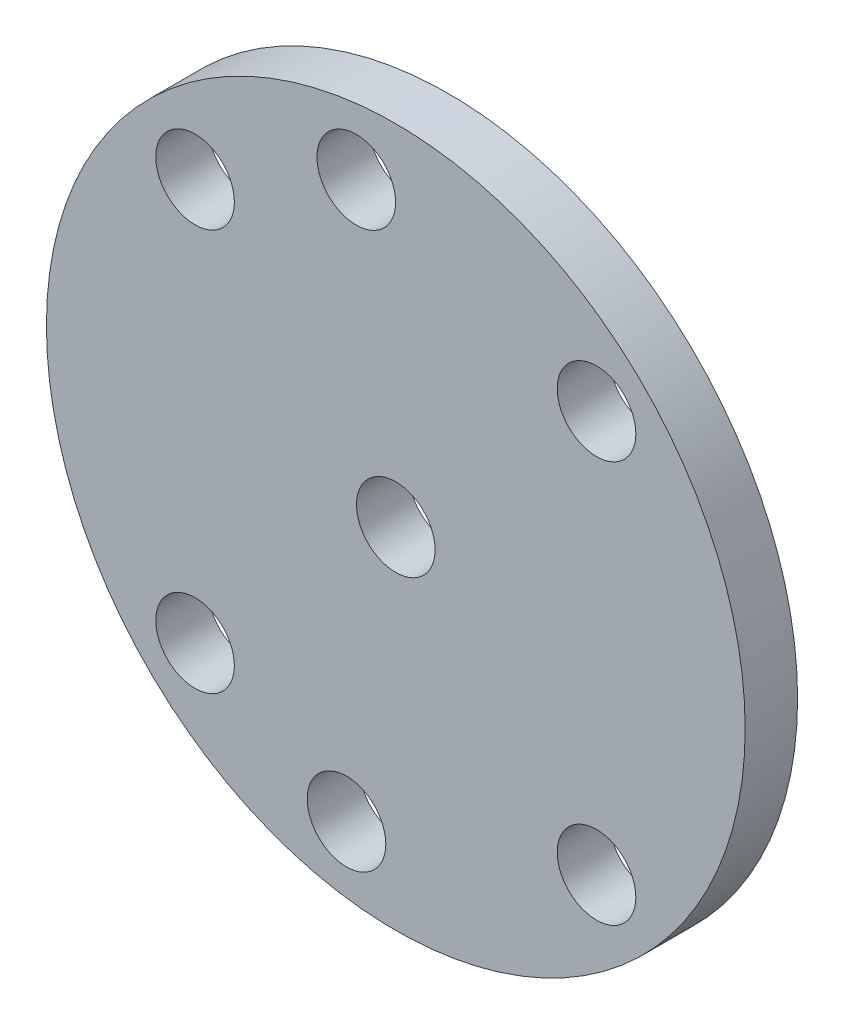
ISO-10303-21;
HEADER;
FILE_DESCRIPTION(('STEP AP214'),'2;1');
FILE_NAME('part.step','',(''),(''),'','','');
FILE_SCHEMA(('AUTOMOTIVE_DESIGN { 1 0 10303 214 1 1 1 1 }'));
ENDSEC;
DATA;
#1=APPLICATION_CONTEXT('core data for automotive mechanical design processes');
#2=APPLICATION_PROTOCOL_DEFINITION('international standard','automotive_design',2000,#1);
#3=PRODUCT_CONTEXT('',#1,'mechanical');
#4=PRODUCT('Part','Part','',(#3));
#5=PRODUCT_RELATED_PRODUCT_CATEGORY('part','',(#4));
#6=PRODUCT_DEFINITION_FORMATION('','',#4);
#7=PRODUCT_DEFINITION_CONTEXT('part definition',#1,'design');
#8=PRODUCT_DEFINITION('design','',#6,#7);
#9=PRODUCT_DEFINITION_SHAPE('','',#8);
#10=(LENGTH_UNIT() NAMED_UNIT(*) SI_UNIT(.MILLI.,.METRE.));
#11=(NAMED_UNIT(*) PLANE_ANGLE_UNIT() SI_UNIT($,.RADIAN.));
#12=(NAMED_UNIT(*) SI_UNIT($,.STERADIAN.) SOLID_ANGLE_UNIT());
#13=UNCERTAINTY_MEASURE_WITH_UNIT(LENGTH_MEASURE(1.E-05),#10,'distance_accuracy_value','');
#14=(GEOMETRIC_REPRESENTATION_CONTEXT(3) GLOBAL_UNCERTAINTY_ASSIGNED_CONTEXT((#13)) GLOBAL_UNIT_ASSIGNED_CONTEXT((#10,
#11,#12)) REPRESENTATION_CONTEXT('',''));
#15=CARTESIAN_POINT('',(0.,0.,0.));
#16=DIRECTION('',(0.,0.,1.));
#17=DIRECTION('',(1.,0.,0.));
#18=AXIS2_PLACEMENT_3D('',#15,#16,#17);
#19=CARTESIAN_POINT('',(0.,0.,6.));
#20=DIRECTION('',(0.,0.,1.));
#21=DIRECTION('',(1.,0.,0.));
#22=AXIS2_PLACEMENT_3D('',#19,#20,#21);
#23=PLANE('',#22);
#24=CARTESIAN_POINT('',(-4.52312578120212,32.183712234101,6.));
#25=DIRECTION('',(0.,0.,1.));
#26=DIRECTION('',(1.,0.,0.));
#27=AXIS2_PLACEMENT_3D('',#24,#25,#26);
#28=CIRCLE('',#27,4.5);
#29=CARTESIAN_POINT('',(-0.0231257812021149,32.183712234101,6.));
#30=VERTEX_POINT('',#29);
#31=EDGE_CURVE('E74',#30,#30,#28,.T.);
#32=ORIENTED_EDGE('',*,*,#31,.F.);
#33=EDGE_LOOP('',(#32));
#34=FACE_BOUND('',#33,.T.);
#35=CARTESIAN_POINT('',(-22.9809703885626,-22.980970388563,6.));
#36=DIRECTION('',(0.,0.,1.));
#37=DIRECTION('',(1.,0.,0.));
#38=AXIS2_PLACEMENT_3D('',#35,#36,#37);
#39=CIRCLE('',#38,4.49999999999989);
#40=CARTESIAN_POINT('',(-18.4809703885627,-22.980970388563,6.));
#41=VERTEX_POINT('',#40);
#42=EDGE_CURVE('E62',#41,#41,#39,.T.);
#43=ORIENTED_EDGE('',*,*,#42,.F.);
#44=EDGE_LOOP('',(#43));
#45=FACE_BOUND('',#44,.T.);
#46=CARTESIAN_POINT('',(22.9809703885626,22.980970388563,6.));
#47=DIRECTION('',(0.,0.,1.));
#48=DIRECTION('',(1.,0.,0.));
#49=AXIS2_PLACEMENT_3D('',#46,#47,#48);
#50=CIRCLE('',#49,4.50000000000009);
#51=CARTESIAN_POINT('',(27.4809703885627,22.980970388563,6.));
#52=VERTEX_POINT('',#51);
#53=EDGE_CURVE('E50',#52,#52,#50,.T.);
#54=ORIENTED_EDGE('',*,*,#53,.F.);
#55=EDGE_LOOP('',(#54));
#56=FACE_BOUND('',#55,.T.);
#57=CARTESIAN_POINT('',(0.,0.,6.));
#58=DIRECTION('',(0.,0.,1.));
#59=DIRECTION('',(1.,0.,0.));
#60=AXIS2_PLACEMENT_3D('',#57,#58,#59);
#61=CIRCLE('',#60,40.);
#62=CARTESIAN_POINT('',(40.,0.,6.));
#63=VERTEX_POINT('',#62);
#64=EDGE_CURVE('E10',#63,#63,#61,.T.);
#65=ORIENTED_EDGE('',*,*,#64,.T.);
#66=EDGE_LOOP('',(#65));
#67=FACE_BOUND('',#66,.T.);
#68=CARTESIAN_POINT('',(22.980970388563,-22.9809703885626,6.));
#69=DIRECTION('',(0.,0.,1.));
#70=DIRECTION('',(1.,0.,0.));
#71=AXIS2_PLACEMENT_3D('',#68,#69,#70);
#72=CIRCLE('',#71,4.49999999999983);
#73=CARTESIAN_POINT('',(27.4809703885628,-22.9809703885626,6.));
#74=VERTEX_POINT('',#73);
#75=EDGE_CURVE('E41',#74,#74,#72,.T.);
#76=ORIENTED_EDGE('',*,*,#75,.F.);
#77=EDGE_LOOP('',(#76));
#78=FACE_BOUND('',#77,.T.);
#79=CARTESIAN_POINT('',(-22.980970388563,22.9809703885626,6.));
#80=DIRECTION('',(0.,0.,1.));
#81=DIRECTION('',(1.,0.,0.));
#82=AXIS2_PLACEMENT_3D('',#79,#80,#81);
#83=CIRCLE('',#82,4.50000000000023);
#84=CARTESIAN_POINT('',(-18.4809703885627,22.9809703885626,6.));
#85=VERTEX_POINT('',#84);
#86=EDGE_CURVE('E56',#85,#85,#83,.T.);
#87=ORIENTED_EDGE('',*,*,#86,.F.);
#88=EDGE_LOOP('',(#87));
#89=FACE_BOUND('',#88,.T.);
#90=CARTESIAN_POINT('',(-5.64356577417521,-32.0062519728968,6.));
#91=DIRECTION('',(0.,0.,1.));
#92=DIRECTION('',(1.,0.,0.));
#93=AXIS2_PLACEMENT_3D('',#90,#91,#92);
#94=CIRCLE('',#93,4.5);
#95=CARTESIAN_POINT('',(-1.14356577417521,-32.0062519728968,6.));
#96=VERTEX_POINT('',#95);
#97=EDGE_CURVE('E68',#96,#96,#94,.T.);
#98=ORIENTED_EDGE('',*,*,#97,.F.);
#99=EDGE_LOOP('',(#98));
#100=FACE_BOUND('',#99,.T.);
#101=CARTESIAN_POINT('',(0.,0.,6.));
#102=DIRECTION('',(0.,0.,1.));
#103=DIRECTION('',(1.,0.,0.));
#104=AXIS2_PLACEMENT_3D('',#101,#102,#103);
#105=CIRCLE('',#104,4.5);
#106=CARTESIAN_POINT('',(4.5,0.,6.));
#107=VERTEX_POINT('',#106);
#108=EDGE_CURVE('E80',#107,#107,#105,.T.);
#109=ORIENTED_EDGE('',*,*,#108,.F.);
#110=EDGE_LOOP('',(#109));
#111=FACE_BOUND('',#110,.T.);
#112=ADVANCED_FACE('F30',(#34,#45,#56,#67,#78,#89,#100,#111),#23,.T.);
#113=CARTESIAN_POINT('',(0.,0.,0.));
#114=DIRECTION('',(0.,0.,1.));
#115=DIRECTION('',(1.,0.,0.));
#116=AXIS2_PLACEMENT_3D('',#113,#114,#115);
#117=PLANE('',#116);
#118=CARTESIAN_POINT('',(-4.52312578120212,32.183712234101,0.));
#119=DIRECTION('',(0.,0.,1.));
#120=DIRECTION('',(1.,0.,0.));
#121=AXIS2_PLACEMENT_3D('',#118,#119,#120);
#122=CIRCLE('',#121,4.5);
#123=CARTESIAN_POINT('',(-0.0231257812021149,32.183712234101,0.));
#124=VERTEX_POINT('',#123);
#125=EDGE_CURVE('E77',#124,#124,#122,.T.);
#126=ORIENTED_EDGE('',*,*,#125,.T.);
#127=EDGE_LOOP('',(#126));
#128=FACE_BOUND('',#127,.T.);
#129=CARTESIAN_POINT('',(-22.9809703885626,-22.980970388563,0.));
#130=DIRECTION('',(0.,0.,1.));
#131=DIRECTION('',(1.,0.,0.));
#132=AXIS2_PLACEMENT_3D('',#129,#130,#131);
#133=CIRCLE('',#132,4.49999999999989);
#134=CARTESIAN_POINT('',(-18.4809703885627,-22.980970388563,0.));
#135=VERTEX_POINT('',#134);
#136=EDGE_CURVE('E65',#135,#135,#133,.T.);
#137=ORIENTED_EDGE('',*,*,#136,.T.);
#138=EDGE_LOOP('',(#137));
#139=FACE_BOUND('',#138,.T.);
#140=CARTESIAN_POINT('',(22.9809703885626,22.980970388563,0.));
#141=DIRECTION('',(0.,0.,1.));
#142=DIRECTION('',(1.,0.,0.));
#143=AXIS2_PLACEMENT_3D('',#140,#141,#142);
#144=CIRCLE('',#143,4.50000000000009);
#145=CARTESIAN_POINT('',(27.4809703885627,22.980970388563,0.));
#146=VERTEX_POINT('',#145);
#147=EDGE_CURVE('E53',#146,#146,#144,.T.);
#148=ORIENTED_EDGE('',*,*,#147,.T.);
#149=EDGE_LOOP('',(#148));
#150=FACE_BOUND('',#149,.T.);
#151=CARTESIAN_POINT('',(0.,0.,0.));
#152=DIRECTION('',(0.,0.,1.));
#153=DIRECTION('',(1.,0.,0.));
#154=AXIS2_PLACEMENT_3D('',#151,#152,#153);
#155=CIRCLE('',#154,40.);
#156=CARTESIAN_POINT('',(40.,0.,0.));
#157=VERTEX_POINT('',#156);
#158=EDGE_CURVE('E37',#157,#157,#155,.T.);
#159=ORIENTED_EDGE('',*,*,#158,.F.);
#160=EDGE_LOOP('',(#159));
#161=FACE_BOUND('',#160,.T.);
#162=CARTESIAN_POINT('',(22.980970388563,-22.9809703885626,0.));
#163=DIRECTION('',(0.,0.,1.));
#164=DIRECTION('',(1.,0.,0.));
#165=AXIS2_PLACEMENT_3D('',#162,#163,#164);
#166=CIRCLE('',#165,4.49999999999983);
#167=CARTESIAN_POINT('',(27.4809703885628,-22.9809703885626,0.));
#168=VERTEX_POINT('',#167);
#169=EDGE_CURVE('E45',#168,#168,#166,.T.);
#170=ORIENTED_EDGE('',*,*,#169,.T.);
#171=EDGE_LOOP('',(#170));
#172=FACE_BOUND('',#171,.T.);
#173=CARTESIAN_POINT('',(-22.980970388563,22.9809703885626,0.));
#174=DIRECTION('',(0.,0.,1.));
#175=DIRECTION('',(1.,0.,0.));
#176=AXIS2_PLACEMENT_3D('',#173,#174,#175);
#177=CIRCLE('',#176,4.50000000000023);
#178=CARTESIAN_POINT('',(-18.4809703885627,22.9809703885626,0.));
#179=VERTEX_POINT('',#178);
#180=EDGE_CURVE('E59',#179,#179,#177,.T.);
#181=ORIENTED_EDGE('',*,*,#180,.T.);
#182=EDGE_LOOP('',(#181));
#183=FACE_BOUND('',#182,.T.);
#184=CARTESIAN_POINT('',(-5.64356577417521,-32.0062519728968,0.));
#185=DIRECTION('',(0.,0.,1.));
#186=DIRECTION('',(1.,0.,0.));
#187=AXIS2_PLACEMENT_3D('',#184,#185,#186);
#188=CIRCLE('',#187,4.5);
#189=CARTESIAN_POINT('',(-1.14356577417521,-32.0062519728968,0.));
#190=VERTEX_POINT('',#189);
#191=EDGE_CURVE('E71',#190,#190,#188,.T.);
#192=ORIENTED_EDGE('',*,*,#191,.T.);
#193=EDGE_LOOP('',(#192));
#194=FACE_BOUND('',#193,.T.);
#195=CARTESIAN_POINT('',(0.,0.,0.));
#196=DIRECTION('',(0.,0.,1.));
#197=DIRECTION('',(1.,0.,0.));
#198=AXIS2_PLACEMENT_3D('',#195,#196,#197);
#199=CIRCLE('',#198,4.5);
#200=CARTESIAN_POINT('',(4.5,0.,0.));
#201=VERTEX_POINT('',#200);
#202=EDGE_CURVE('E84',#201,#201,#199,.T.);
#203=ORIENTED_EDGE('',*,*,#202,.T.);
#204=EDGE_LOOP('',(#203));
#205=FACE_BOUND('',#204,.T.);
#206=ADVANCED_FACE('F91',(#128,#139,#150,#161,#172,#183,#194,#205),#117,.F.);
#207=CARTESIAN_POINT('',(0.,0.,6.));
#208=DIRECTION('',(0.,0.,-1.));
#209=DIRECTION('',(-1.,0.,0.));
#210=AXIS2_PLACEMENT_3D('',#207,#208,#209);
#211=CYLINDRICAL_SURFACE('',#210,40.);
#212=ORIENTED_EDGE('',*,*,#64,.F.);
#213=EDGE_LOOP('',(#212));
#214=FACE_BOUND('',#213,.T.);
#215=ORIENTED_EDGE('',*,*,#158,.T.);
#216=EDGE_LOOP('',(#215));
#217=FACE_BOUND('',#216,.T.);
#218=ADVANCED_FACE('F32',(#214,#217),#211,.T.);
#219=CARTESIAN_POINT('',(22.980970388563,-22.9809703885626,6.));
#220=DIRECTION('',(0.,0.,-1.));
#221=DIRECTION('',(-1.,0.,0.));
#222=AXIS2_PLACEMENT_3D('',#219,#220,#221);
#223=CYLINDRICAL_SURFACE('',#222,4.49999999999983);
#224=ORIENTED_EDGE('',*,*,#75,.T.);
#225=EDGE_LOOP('',(#224));
#226=FACE_BOUND('',#225,.T.);
#227=ORIENTED_EDGE('',*,*,#169,.F.);
#228=EDGE_LOOP('',(#227));
#229=FACE_BOUND('',#228,.T.);
#230=ADVANCED_FACE('F114',(#226,#229),#223,.F.);
#231=CARTESIAN_POINT('',(22.9809703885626,22.980970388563,6.));
#232=DIRECTION('',(0.,0.,-1.));
#233=DIRECTION('',(-1.,0.,0.));
#234=AXIS2_PLACEMENT_3D('',#231,#232,#233);
#235=CYLINDRICAL_SURFACE('',#234,4.50000000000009);
#236=ORIENTED_EDGE('',*,*,#53,.T.);
#237=EDGE_LOOP('',(#236));
#238=FACE_BOUND('',#237,.T.);
#239=ORIENTED_EDGE('',*,*,#147,.F.);
#240=EDGE_LOOP('',(#239));
#241=FACE_BOUND('',#240,.T.);
#242=ADVANCED_FACE('F117',(#238,#241),#235,.F.);
#243=CARTESIAN_POINT('',(-22.980970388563,22.9809703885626,6.));
#244=DIRECTION('',(0.,0.,-1.));
#245=DIRECTION('',(-1.,0.,0.));
#246=AXIS2_PLACEMENT_3D('',#243,#244,#245);
#247=CYLINDRICAL_SURFACE('',#246,4.50000000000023);
#248=ORIENTED_EDGE('',*,*,#86,.T.);
#249=EDGE_LOOP('',(#248));
#250=FACE_BOUND('',#249,.T.);
#251=ORIENTED_EDGE('',*,*,#180,.F.);
#252=EDGE_LOOP('',(#251));
#253=FACE_BOUND('',#252,.T.);
#254=ADVANCED_FACE('F121',(#250,#253),#247,.F.);
#255=CARTESIAN_POINT('',(-22.9809703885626,-22.980970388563,6.));
#256=DIRECTION('',(0.,0.,-1.));
#257=DIRECTION('',(-1.,0.,0.));
#258=AXIS2_PLACEMENT_3D('',#255,#256,#257);
#259=CYLINDRICAL_SURFACE('',#258,4.49999999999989);
#260=ORIENTED_EDGE('',*,*,#42,.T.);
#261=EDGE_LOOP('',(#260));
#262=FACE_BOUND('',#261,.T.);
#263=ORIENTED_EDGE('',*,*,#136,.F.);
#264=EDGE_LOOP('',(#263));
#265=FACE_BOUND('',#264,.T.);
#266=ADVANCED_FACE('F125',(#262,#265),#259,.F.);
#267=CARTESIAN_POINT('',(-5.64356577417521,-32.0062519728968,6.));
#268=DIRECTION('',(0.,0.,-1.));
#269=DIRECTION('',(-1.,0.,0.));
#270=AXIS2_PLACEMENT_3D('',#267,#268,#269);
#271=CYLINDRICAL_SURFACE('',#270,4.5);
#272=ORIENTED_EDGE('',*,*,#97,.T.);
#273=EDGE_LOOP('',(#272));
#274=FACE_BOUND('',#273,.T.);
#275=ORIENTED_EDGE('',*,*,#191,.F.);
#276=EDGE_LOOP('',(#275));
#277=FACE_BOUND('',#276,.T.);
#278=ADVANCED_FACE('F101',(#274,#277),#271,.F.);
#279=CARTESIAN_POINT('',(-4.52312578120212,32.183712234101,6.));
#280=DIRECTION('',(0.,0.,-1.));
#281=DIRECTION('',(-1.,0.,0.));
#282=AXIS2_PLACEMENT_3D('',#279,#280,#281);
#283=CYLINDRICAL_SURFACE('',#282,4.5);
#284=ORIENTED_EDGE('',*,*,#31,.T.);
#285=EDGE_LOOP('',(#284));
#286=FACE_BOUND('',#285,.T.);
#287=ORIENTED_EDGE('',*,*,#125,.F.);
#288=EDGE_LOOP('',(#287));
#289=FACE_BOUND('',#288,.T.);
#290=ADVANCED_FACE('F95',(#286,#289),#283,.F.);
#291=CARTESIAN_POINT('',(0.,0.,6.));
#292=DIRECTION('',(0.,0.,-1.));
#293=DIRECTION('',(-1.,0.,0.));
#294=AXIS2_PLACEMENT_3D('',#291,#292,#293);
#295=CYLINDRICAL_SURFACE('',#294,4.5);
#296=ORIENTED_EDGE('',*,*,#108,.T.);
#297=EDGE_LOOP('',(#296));
#298=FACE_BOUND('',#297,.T.);
#299=ORIENTED_EDGE('',*,*,#202,.F.);
#300=EDGE_LOOP('',(#299));
#301=FACE_BOUND('',#300,.T.);
#302=ADVANCED_FACE('F93',(#298,#301),#295,.F.);
#303=CLOSED_SHELL('',(#112,#206,#218,#230,#242,#254,#266,#278,#290,#302));
#304=MANIFOLD_SOLID_BREP('B2',#303);
#305=ADVANCED_BREP_SHAPE_REPRESENTATION('',(#18,#304),#14);
#306=SHAPE_DEFINITION_REPRESENTATION(#9,#305);
ENDSEC;
END-ISO-10303-21;
